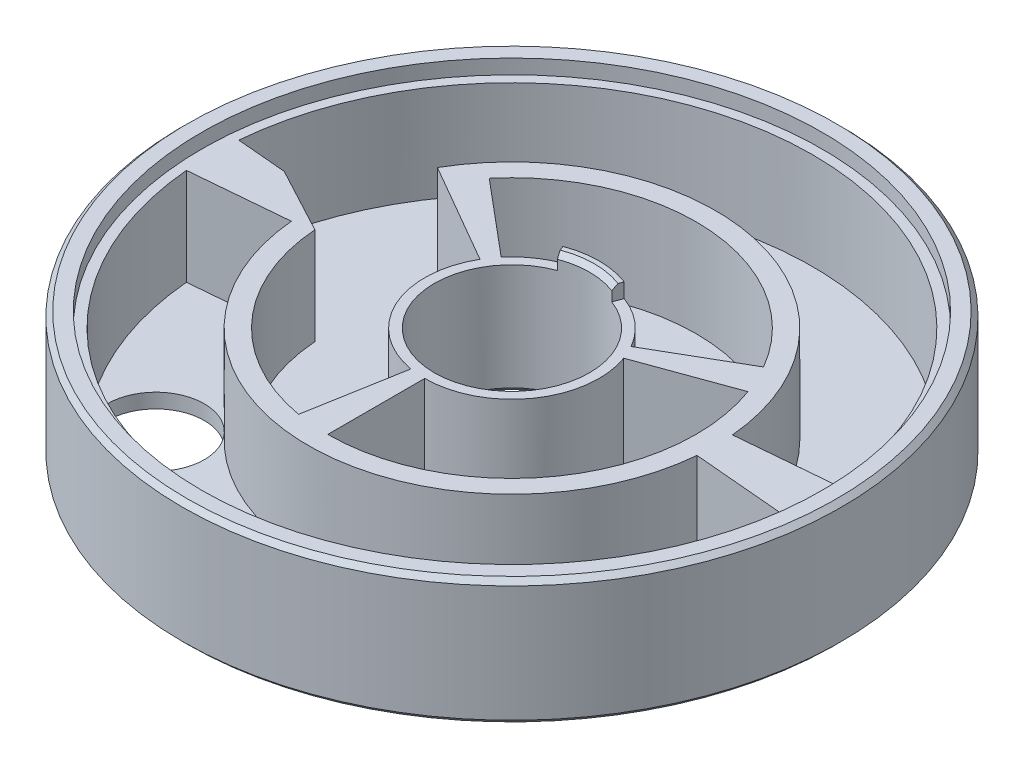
from build123d import *

# Parameters (mm, degrees)
SKETCH1_R           = 34
SKETCH1_R_2         = 8
BOSS_EXTRUDE1_DEPTH = 13
SKETCH2_R           = 32
CUT_EXTRUDE1_DEPTH  = 1.5
CHAMFER1_SIZE       = 0.5
CUT_REVOLVE1_ANGLE  = 110
CIRPATTERN1_COUNT   = 3
CUT_REVOLVE2_ANGLE  = 170
CIRPATTERN2_COUNT   = 2
CUT_EXTRUDE2_DEPTH  = 11.5
SKETCH6_R           = 5
CUT_EXTRUDE3_DEPTH  = 50.439356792


with BuildPart() as part:
    # Sketch1 → Boss-Extrude1 (new body)
    with BuildSketch(Plane(origin=(0, 0, 0), x_dir=(1, 0, 0), z_dir=(0, 1, 0))):
        with Locations(Location((0, 0, 0), (0, 0, 270))):
            Circle(SKETCH1_R)
        with Locations(Location((0, 0, 0), (0, 0, 270))):
            Circle(SKETCH1_R_2, mode=Mode.SUBTRACT)
    extrude(amount=-BOSS_EXTRUDE1_DEPTH)

    # Sketch2 → Cut-Extrude1 (cut)
    with BuildSketch(Plane(origin=(0, 0, 0), x_dir=(1, 0, 0), z_dir=(0, 1, 0))):
        with Locations(Location((0, 0, 0), (0, 0, 270))):
            Circle(SKETCH2_R)
        with BuildLine():
            Line((-2.808987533, 7.490633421), (-3.160110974, 8.426962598))
            ThreePointArc((-3.160110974, 8.426962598), (0, 9), (3.160110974, 8.426962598))
            Line((3.160110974, 8.426962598), (2.808987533, 7.490633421))
            ThreePointArc((2.808987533, 7.490633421), (0, -8), (-2.808987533, 7.490633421))
        make_face(mode=Mode.SUBTRACT)
    extrude(amount=-CUT_EXTRUDE1_DEPTH, mode=Mode.SUBTRACT)

    # Chamfer1
    chamfer1_edges = [part.edges().sort_by_distance(p)[0] for p in [
        (0, 0, -34),
        (0, -13, -34),
        (0, -13, -8),
        (0, 0, -8),
    ]]
    chamfer(chamfer1_edges, length=CHAMFER1_SIZE)

    # Sketch3 → Cut-Revolve1 (revolve, cut)
    with BuildSketch(Plane(origin=(0, 0, 0), x_dir=(0, 0, -1), z_dir=(1, 0, 0))):
        Polygon((-14, 0), (-19, 0), (-19, -11.5), (-9, -11.5), (-9, 0), align=None)
    cut_revolve1 = revolve(axis=Axis((0, -12.5, 0), (0, 1, 0)), revolution_arc=CUT_REVOLVE1_ANGLE, mode=Mode.SUBTRACT)

    # CirPattern1: Cut-Revolve1 ×3 about axis
    cirpattern1_axis = Axis((0, 0, 0), (0, 1, 0))
    for i in range(1, CIRPATTERN1_COUNT):
        add(cut_revolve1.rotate(cirpattern1_axis, i * 360 / CIRPATTERN1_COUNT), mode=Mode.SUBTRACT)

    # Sketch4 → Cut-Revolve2 (revolve, symmetric, cut)
    with BuildSketch(Plane(origin=(0, 0, 0), x_dir=(0, 0, -1), z_dir=(1, 0, 0))) as cut_revolve2_sk:
        Polygon((-26, 0), (-31, 0), (-31, -11.5), (-21, -11.5), (-21, 0), align=None)
    cut_revolve2 = revolve(axis=Axis((0, -12.5, 0), (0, 1, 0)), revolution_arc=CUT_REVOLVE2_ANGLE / 2, mode=Mode.SUBTRACT)
    cut_revolve2 = cut_revolve2 + revolve(cut_revolve2_sk.sketch, axis=Axis((0, -12.5, 0), (0, -1, 0)), revolution_arc=CUT_REVOLVE2_ANGLE / 2, mode=Mode.SUBTRACT)

    # CirPattern2: Cut-Revolve2 ×2 about axis
    cirpattern2_axis = Axis((0, 0, 0), (0, 1, 0))
    for i in range(1, CIRPATTERN2_COUNT):
        add(cut_revolve2.rotate(cirpattern2_axis, i * 360 / CIRPATTERN2_COUNT), mode=Mode.SUBTRACT)

    # Sketch5 → Cut-Extrude2 (cut)
    with BuildSketch(Plane(origin=(0, 0, 0), x_dir=(1, 0, 0), z_dir=(0, 1, 0))):
        Polygon((-16.454482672, 9.5), (-19.770105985, 11.414276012), (-27.192099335, 3.025009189), (-21.529155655, 0), (-17.837276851, -1.972113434), align=None)
    extrude(amount=-CUT_EXTRUDE2_DEPTH, mode=Mode.SUBTRACT)

    # Sketch6 → Cut-Extrude3 (cut, through all)
    with BuildSketch(Plane(origin=(0, -11.5, 0), x_dir=(1, 0, 0), z_dir=(0, 1, 0))):
        with Locations(Location((24.953391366, 7.302620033, 0), (0, 0, 270))):
            Circle(SKETCH6_R)
        with Locations(Location((13.97091909, -0.901897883, 0), (0, 0, 270))):
            Circle(SKETCH6_R)
        with Locations(Location((-19.109751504, -17.630014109, 0), (0, 0, 270))):
            Circle(SKETCH6_R)
    extrude(amount=-CUT_EXTRUDE3_DEPTH, mode=Mode.SUBTRACT)


solid = part.part
